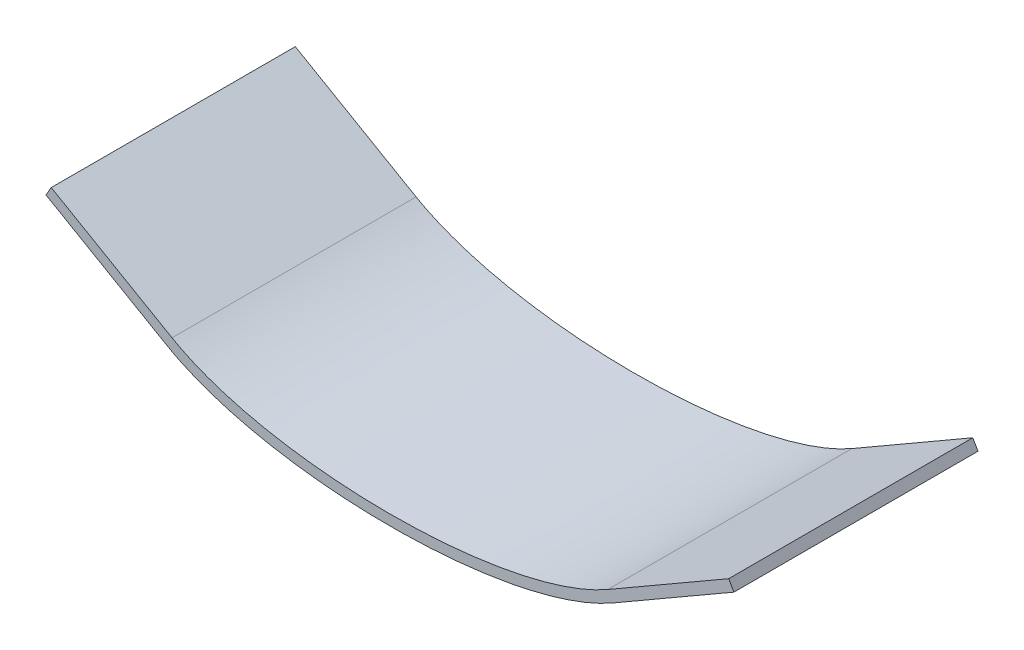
ISO-10303-21;
HEADER;
FILE_DESCRIPTION(('STEP AP214'),'2;1');
FILE_NAME('part.step','',(''),(''),'','','');
FILE_SCHEMA(('AUTOMOTIVE_DESIGN { 1 0 10303 214 1 1 1 1 }'));
ENDSEC;
DATA;
#1=APPLICATION_CONTEXT('core data for automotive mechanical design processes');
#2=APPLICATION_PROTOCOL_DEFINITION('international standard','automotive_design',2000,#1);
#3=PRODUCT_CONTEXT('',#1,'mechanical');
#4=PRODUCT('Part','Part','',(#3));
#5=PRODUCT_RELATED_PRODUCT_CATEGORY('part','',(#4));
#6=PRODUCT_DEFINITION_FORMATION('','',#4);
#7=PRODUCT_DEFINITION_CONTEXT('part definition',#1,'design');
#8=PRODUCT_DEFINITION('design','',#6,#7);
#9=PRODUCT_DEFINITION_SHAPE('','',#8);
#10=(LENGTH_UNIT() NAMED_UNIT(*) SI_UNIT(.MILLI.,.METRE.));
#11=(NAMED_UNIT(*) PLANE_ANGLE_UNIT() SI_UNIT($,.RADIAN.));
#12=(NAMED_UNIT(*) SI_UNIT($,.STERADIAN.) SOLID_ANGLE_UNIT());
#13=UNCERTAINTY_MEASURE_WITH_UNIT(LENGTH_MEASURE(1.E-05),#10,'distance_accuracy_value','');
#14=(GEOMETRIC_REPRESENTATION_CONTEXT(3) GLOBAL_UNCERTAINTY_ASSIGNED_CONTEXT((#13)) GLOBAL_UNIT_ASSIGNED_CONTEXT((#10,
#11,#12)) REPRESENTATION_CONTEXT('',''));
#15=CARTESIAN_POINT('',(0.,0.,0.));
#16=DIRECTION('',(0.,0.,1.));
#17=DIRECTION('',(1.,0.,0.));
#18=AXIS2_PLACEMENT_3D('',#15,#16,#17);
#19=CARTESIAN_POINT('',(-15.875,0.,17.78));
#20=DIRECTION('',(-0.499999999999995,-0.866025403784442,0.));
#21=DIRECTION('',(0.866025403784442,-0.499999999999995,0.));
#22=AXIS2_PLACEMENT_3D('',#19,#20,#21);
#23=PLANE('',#22);
#24=DIRECTION('',(-0.866025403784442,0.499999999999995,0.));
#25=VECTOR('',#24,1.);
#26=CARTESIAN_POINT('',(-15.875,0.,0.));
#27=LINE('',#26,#25);
#28=CARTESIAN_POINT('',(-15.875,0.,0.));
#29=VERTEX_POINT('',#28);
#30=CARTESIAN_POINT('',(-24.6738181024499,5.07999999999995,0.));
#31=VERTEX_POINT('',#30);
#32=EDGE_CURVE('E143',#29,#31,#27,.T.);
#33=ORIENTED_EDGE('',*,*,#32,.T.);
#34=DIRECTION('',(0.,0.,-1.));
#35=VECTOR('',#34,1.);
#36=CARTESIAN_POINT('',(-24.6738181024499,5.07999999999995,17.78));
#37=LINE('',#36,#35);
#38=CARTESIAN_POINT('',(-24.6738181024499,5.07999999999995,17.78));
#39=VERTEX_POINT('',#38);
#40=EDGE_CURVE('E11',#39,#31,#37,.T.);
#41=ORIENTED_EDGE('',*,*,#40,.F.);
#42=DIRECTION('',(-0.866025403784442,0.499999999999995,0.));
#43=VECTOR('',#42,1.);
#44=CARTESIAN_POINT('',(-15.875,0.,17.78));
#45=LINE('',#44,#43);
#46=CARTESIAN_POINT('',(-15.875,0.,17.78));
#47=VERTEX_POINT('',#46);
#48=EDGE_CURVE('E98',#47,#39,#45,.T.);
#49=ORIENTED_EDGE('',*,*,#48,.F.);
#50=DIRECTION('',(0.,0.,-1.));
#51=VECTOR('',#50,1.);
#52=CARTESIAN_POINT('',(-15.875,0.,17.78));
#53=LINE('',#52,#51);
#54=EDGE_CURVE('E142',#47,#29,#53,.T.);
#55=ORIENTED_EDGE('',*,*,#54,.T.);
#56=EDGE_LOOP('',(#33,#41,#49,#55));
#57=FACE_BOUND('',#56,.T.);
#58=ADVANCED_FACE('F43',(#57),#23,.F.);
#59=CARTESIAN_POINT('',(-25.0548181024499,4.4200886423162,17.78));
#60=DIRECTION('',(-0.866025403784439,0.499999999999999,0.));
#61=DIRECTION('',(-0.499999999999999,-0.866025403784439,0.));
#62=AXIS2_PLACEMENT_3D('',#59,#60,#61);
#63=PLANE('',#62);
#64=DIRECTION('',(0.499999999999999,0.866025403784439,0.));
#65=VECTOR('',#64,1.);
#66=CARTESIAN_POINT('',(-25.0548181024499,4.4200886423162,0.));
#67=LINE('',#66,#65);
#68=CARTESIAN_POINT('',(-25.0548181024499,4.4200886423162,0.));
#69=VERTEX_POINT('',#68);
#70=EDGE_CURVE('E206',#69,#31,#67,.T.);
#71=ORIENTED_EDGE('',*,*,#70,.F.);
#72=DIRECTION('',(0.,0.,-1.));
#73=VECTOR('',#72,1.);
#74=CARTESIAN_POINT('',(-25.0548181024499,4.4200886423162,17.78));
#75=LINE('',#74,#73);
#76=CARTESIAN_POINT('',(-25.0548181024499,4.4200886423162,17.78));
#77=VERTEX_POINT('',#76);
#78=EDGE_CURVE('E51',#77,#69,#75,.T.);
#79=ORIENTED_EDGE('',*,*,#78,.F.);
#80=DIRECTION('',(0.499999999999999,0.866025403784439,0.));
#81=VECTOR('',#80,1.);
#82=CARTESIAN_POINT('',(-25.0548181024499,4.4200886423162,17.78));
#83=LINE('',#82,#81);
#84=EDGE_CURVE('E179',#77,#39,#83,.T.);
#85=ORIENTED_EDGE('',*,*,#84,.T.);
#86=ORIENTED_EDGE('',*,*,#40,.T.);
#87=EDGE_LOOP('',(#71,#79,#85,#86));
#88=FACE_BOUND('',#87,.T.);
#89=ADVANCED_FACE('F207',(#88),#63,.T.);
#90=CARTESIAN_POINT('',(-16.256,-0.659911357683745,17.78));
#91=DIRECTION('',(-0.499999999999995,-0.866025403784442,0.));
#92=DIRECTION('',(0.866025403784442,-0.499999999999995,0.));
#93=AXIS2_PLACEMENT_3D('',#90,#91,#92);
#94=PLANE('',#93);
#95=DIRECTION('',(-0.866025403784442,0.499999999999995,0.));
#96=VECTOR('',#95,1.);
#97=CARTESIAN_POINT('',(-16.256,-0.659911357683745,0.));
#98=LINE('',#97,#96);
#99=CARTESIAN_POINT('',(-16.256,-0.659911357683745,0.));
#100=VERTEX_POINT('',#99);
#101=EDGE_CURVE('E201',#100,#69,#98,.T.);
#102=ORIENTED_EDGE('',*,*,#101,.F.);
#103=DIRECTION('',(0.,0.,-1.));
#104=VECTOR('',#103,1.);
#105=CARTESIAN_POINT('',(-16.256,-0.659911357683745,17.78));
#106=LINE('',#105,#104);
#107=CARTESIAN_POINT('',(-16.256,-0.659911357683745,17.78));
#108=VERTEX_POINT('',#107);
#109=EDGE_CURVE('E196',#108,#100,#106,.T.);
#110=ORIENTED_EDGE('',*,*,#109,.F.);
#111=DIRECTION('',(-0.866025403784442,0.499999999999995,0.));
#112=VECTOR('',#111,1.);
#113=CARTESIAN_POINT('',(-16.256,-0.659911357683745,17.78));
#114=LINE('',#113,#112);
#115=EDGE_CURVE('E173',#108,#77,#114,.T.);
#116=ORIENTED_EDGE('',*,*,#115,.T.);
#117=ORIENTED_EDGE('',*,*,#78,.T.);
#118=EDGE_LOOP('',(#102,#110,#116,#117));
#119=FACE_BOUND('',#118,.T.);
#120=ADVANCED_FACE('F166',(#119),#94,.T.);
#121=CARTESIAN_POINT('',(16.256,-0.659911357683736,17.78));
#122=CARTESIAN_POINT('',(15.2839702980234,-1.22111296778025,17.78));
#123=CARTESIAN_POINT('',(14.1700715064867,-1.70180875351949,17.78));
#124=CARTESIAN_POINT('',(11.7271635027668,-2.52120351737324,17.78));
#125=CARTESIAN_POINT('',(10.3979672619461,-2.85946393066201,17.78));
#126=CARTESIAN_POINT('',(6.19193156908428,-3.66956523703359,17.78));
#127=CARTESIAN_POINT('',(3.09624289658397,-3.93699999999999,17.78));
#128=CARTESIAN_POINT('',(-3.09624289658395,-3.93699999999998,17.78));
#129=CARTESIAN_POINT('',(-6.19193156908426,-3.66956523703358,17.78));
#130=CARTESIAN_POINT('',(-10.3979672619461,-2.859463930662,17.78));
#131=CARTESIAN_POINT('',(-11.7271635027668,-2.52120351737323,17.78));
#132=CARTESIAN_POINT('',(-14.1700715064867,-1.70180875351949,17.78));
#133=CARTESIAN_POINT('',(-15.2839702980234,-1.22111296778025,17.78));
#134=CARTESIAN_POINT('',(-16.256,-0.659911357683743,17.78));
#135=B_SPLINE_CURVE_WITH_KNOTS('',3,(#121,#122,#123,#124,#125,#126,#127,#128,#129,#130,#131,
#132,#133,#134),.UNSPECIFIED.,.F.,.F.,(4,2,2,2,2,2,4),(0.,0.125,0.25,0.5,0.75,0.875,1.),.UNSPECIFIED.);
#136=DIRECTION('',(0.,0.,-1.));
#137=VECTOR('',#136,1.);
#138=SURFACE_OF_LINEAR_EXTRUSION('',#135,#137);
#139=CARTESIAN_POINT('',(16.256,-0.659911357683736,0.));
#140=CARTESIAN_POINT('',(15.2839702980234,-1.22111296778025,0.));
#141=CARTESIAN_POINT('',(14.1700715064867,-1.70180875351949,0.));
#142=CARTESIAN_POINT('',(11.7271635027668,-2.52120351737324,0.));
#143=CARTESIAN_POINT('',(10.3979672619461,-2.85946393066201,0.));
#144=CARTESIAN_POINT('',(6.19193156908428,-3.66956523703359,0.));
#145=CARTESIAN_POINT('',(3.09624289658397,-3.93699999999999,0.));
#146=CARTESIAN_POINT('',(-3.09624289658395,-3.93699999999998,0.));
#147=CARTESIAN_POINT('',(-6.19193156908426,-3.66956523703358,0.));
#148=CARTESIAN_POINT('',(-10.3979672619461,-2.859463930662,0.));
#149=CARTESIAN_POINT('',(-11.7271635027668,-2.52120351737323,0.));
#150=CARTESIAN_POINT('',(-14.1700715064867,-1.70180875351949,0.));
#151=CARTESIAN_POINT('',(-15.2839702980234,-1.22111296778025,0.));
#152=CARTESIAN_POINT('',(-16.256,-0.659911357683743,0.));
#153=B_SPLINE_CURVE_WITH_KNOTS('',3,(#139,#140,#141,#142,#143,#144,#145,#146,#147,#148,#149,
#150,#151,#152),.UNSPECIFIED.,.F.,.F.,(4,2,2,2,2,2,4),(0.,0.125,0.25,0.5,0.75,0.875,1.),.UNSPECIFIED.);
#154=CARTESIAN_POINT('',(16.256,-0.659911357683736,0.));
#155=VERTEX_POINT('',#154);
#156=EDGE_CURVE('E213',#155,#100,#153,.T.);
#157=ORIENTED_EDGE('',*,*,#156,.F.);
#158=DIRECTION('',(0.,0.,-1.));
#159=VECTOR('',#158,1.);
#160=CARTESIAN_POINT('',(16.256,-0.659911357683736,17.78));
#161=LINE('',#160,#159);
#162=CARTESIAN_POINT('',(16.256,-0.659911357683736,17.78));
#163=VERTEX_POINT('',#162);
#164=EDGE_CURVE('E194',#163,#155,#161,.T.);
#165=ORIENTED_EDGE('',*,*,#164,.F.);
#166=EDGE_CURVE('E134',#163,#108,#135,.T.);
#167=ORIENTED_EDGE('',*,*,#166,.T.);
#168=ORIENTED_EDGE('',*,*,#109,.T.);
#169=EDGE_LOOP('',(#157,#165,#167,#168));
#170=FACE_BOUND('',#169,.T.);
#171=ADVANCED_FACE('F162',(#170),#138,.T.);
#172=CARTESIAN_POINT('',(16.256,-0.659911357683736,17.78));
#173=DIRECTION('',(0.500000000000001,-0.866025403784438,0.));
#174=DIRECTION('',(0.866025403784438,0.500000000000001,0.));
#175=AXIS2_PLACEMENT_3D('',#172,#173,#174);
#176=PLANE('',#175);
#177=DIRECTION('',(-0.866025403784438,-0.500000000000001,0.));
#178=VECTOR('',#177,1.);
#179=CARTESIAN_POINT('',(16.256,-0.659911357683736,0.));
#180=LINE('',#179,#178);
#181=CARTESIAN_POINT('',(25.0548181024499,4.42008864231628,0.));
#182=VERTEX_POINT('',#181);
#183=EDGE_CURVE('E215',#182,#155,#180,.T.);
#184=ORIENTED_EDGE('',*,*,#183,.F.);
#185=DIRECTION('',(0.,0.,-1.));
#186=VECTOR('',#185,1.);
#187=CARTESIAN_POINT('',(25.0548181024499,4.42008864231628,17.78));
#188=LINE('',#187,#186);
#189=CARTESIAN_POINT('',(25.0548181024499,4.42008864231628,17.78));
#190=VERTEX_POINT('',#189);
#191=EDGE_CURVE('E122',#190,#182,#188,.T.);
#192=ORIENTED_EDGE('',*,*,#191,.F.);
#193=DIRECTION('',(-0.866025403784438,-0.500000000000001,0.));
#194=VECTOR('',#193,1.);
#195=CARTESIAN_POINT('',(16.256,-0.659911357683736,17.78));
#196=LINE('',#195,#194);
#197=EDGE_CURVE('E132',#190,#163,#196,.T.);
#198=ORIENTED_EDGE('',*,*,#197,.T.);
#199=ORIENTED_EDGE('',*,*,#164,.T.);
#200=EDGE_LOOP('',(#184,#192,#198,#199));
#201=FACE_BOUND('',#200,.T.);
#202=ADVANCED_FACE('F159',(#201),#176,.T.);
#203=CARTESIAN_POINT('',(24.6738181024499,5.08000000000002,17.78));
#204=DIRECTION('',(0.866025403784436,0.500000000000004,0.));
#205=DIRECTION('',(-0.500000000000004,0.866025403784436,0.));
#206=AXIS2_PLACEMENT_3D('',#203,#204,#205);
#207=PLANE('',#206);
#208=DIRECTION('',(0.500000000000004,-0.866025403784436,0.));
#209=VECTOR('',#208,1.);
#210=CARTESIAN_POINT('',(24.6738181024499,5.08000000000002,0.));
#211=LINE('',#210,#209);
#212=CARTESIAN_POINT('',(24.6738181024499,5.08000000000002,0.));
#213=VERTEX_POINT('',#212);
#214=EDGE_CURVE('E121',#213,#182,#211,.T.);
#215=ORIENTED_EDGE('',*,*,#214,.F.);
#216=DIRECTION('',(0.,0.,-1.));
#217=VECTOR('',#216,1.);
#218=CARTESIAN_POINT('',(24.6738181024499,5.08000000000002,17.78));
#219=LINE('',#218,#217);
#220=CARTESIAN_POINT('',(24.6738181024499,5.08000000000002,17.78));
#221=VERTEX_POINT('',#220);
#222=EDGE_CURVE('E115',#221,#213,#219,.T.);
#223=ORIENTED_EDGE('',*,*,#222,.F.);
#224=DIRECTION('',(0.500000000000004,-0.866025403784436,0.));
#225=VECTOR('',#224,1.);
#226=CARTESIAN_POINT('',(24.6738181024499,5.08000000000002,17.78));
#227=LINE('',#226,#225);
#228=EDGE_CURVE('E119',#221,#190,#227,.T.);
#229=ORIENTED_EDGE('',*,*,#228,.T.);
#230=ORIENTED_EDGE('',*,*,#191,.T.);
#231=EDGE_LOOP('',(#215,#223,#229,#230));
#232=FACE_BOUND('',#231,.T.);
#233=ADVANCED_FACE('F117',(#232),#207,.T.);
#234=CARTESIAN_POINT('',(15.875,0.,17.78));
#235=DIRECTION('',(0.500000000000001,-0.866025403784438,0.));
#236=DIRECTION('',(0.866025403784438,0.500000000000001,0.));
#237=AXIS2_PLACEMENT_3D('',#234,#235,#236);
#238=PLANE('',#237);
#239=DIRECTION('',(-0.866025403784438,-0.500000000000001,0.));
#240=VECTOR('',#239,1.);
#241=CARTESIAN_POINT('',(15.875,0.,0.));
#242=LINE('',#241,#240);
#243=CARTESIAN_POINT('',(15.875,0.,0.));
#244=VERTEX_POINT('',#243);
#245=EDGE_CURVE('E86',#213,#244,#242,.T.);
#246=ORIENTED_EDGE('',*,*,#245,.T.);
#247=DIRECTION('',(0.,0.,-1.));
#248=VECTOR('',#247,1.);
#249=CARTESIAN_POINT('',(15.875,0.,17.78));
#250=LINE('',#249,#248);
#251=CARTESIAN_POINT('',(15.875,0.,17.78));
#252=VERTEX_POINT('',#251);
#253=EDGE_CURVE('E123',#252,#244,#250,.T.);
#254=ORIENTED_EDGE('',*,*,#253,.F.);
#255=DIRECTION('',(-0.866025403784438,-0.500000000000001,0.));
#256=VECTOR('',#255,1.);
#257=CARTESIAN_POINT('',(15.875,0.,17.78));
#258=LINE('',#257,#256);
#259=EDGE_CURVE('E125',#221,#252,#258,.T.);
#260=ORIENTED_EDGE('',*,*,#259,.F.);
#261=ORIENTED_EDGE('',*,*,#222,.T.);
#262=EDGE_LOOP('',(#246,#254,#260,#261));
#263=FACE_BOUND('',#262,.T.);
#264=ADVANCED_FACE('F126',(#263),#238,.F.);
#265=CARTESIAN_POINT('',(15.875,0.,17.78));
#266=CARTESIAN_POINT('',(8.54265158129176,-4.23333333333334,17.78));
#267=CARTESIAN_POINT('',(-8.54265158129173,-4.23333333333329,17.78));
#268=CARTESIAN_POINT('',(-15.875,0.,17.78));
#269=B_SPLINE_CURVE_WITH_KNOTS('',3,(#265,#266,#267,#268),.UNSPECIFIED.,.F.,.F.,(4,4),(0.,1.),.UNSPECIFIED.);
#270=DIRECTION('',(0.,0.,-1.));
#271=VECTOR('',#270,1.);
#272=SURFACE_OF_LINEAR_EXTRUSION('',#269,#271);
#273=CARTESIAN_POINT('',(15.875,0.,0.));
#274=CARTESIAN_POINT('',(8.54265158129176,-4.23333333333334,0.));
#275=CARTESIAN_POINT('',(-8.54265158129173,-4.23333333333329,0.));
#276=CARTESIAN_POINT('',(-15.875,0.,0.));
#277=B_SPLINE_CURVE_WITH_KNOTS('',3,(#273,#274,#275,#276),.UNSPECIFIED.,.F.,.F.,(4,4),(0.,1.),.UNSPECIFIED.);
#278=EDGE_CURVE('E92',#244,#29,#277,.T.);
#279=ORIENTED_EDGE('',*,*,#278,.T.);
#280=ORIENTED_EDGE('',*,*,#54,.F.);
#281=EDGE_CURVE('E59',#252,#47,#269,.T.);
#282=ORIENTED_EDGE('',*,*,#281,.F.);
#283=ORIENTED_EDGE('',*,*,#253,.T.);
#284=EDGE_LOOP('',(#279,#280,#282,#283));
#285=FACE_BOUND('',#284,.T.);
#286=ADVANCED_FACE('F149',(#285),#272,.F.);
#287=CARTESIAN_POINT('',(0.,-3.93699999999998,17.78));
#288=DIRECTION('',(0.,0.,1.));
#289=DIRECTION('',(1.,0.,0.));
#290=AXIS2_PLACEMENT_3D('',#287,#288,#289);
#291=PLANE('',#290);
#292=ORIENTED_EDGE('',*,*,#48,.T.);
#293=ORIENTED_EDGE('',*,*,#84,.F.);
#294=ORIENTED_EDGE('',*,*,#115,.F.);
#295=ORIENTED_EDGE('',*,*,#166,.F.);
#296=ORIENTED_EDGE('',*,*,#197,.F.);
#297=ORIENTED_EDGE('',*,*,#228,.F.);
#298=ORIENTED_EDGE('',*,*,#259,.T.);
#299=ORIENTED_EDGE('',*,*,#281,.T.);
#300=EDGE_LOOP('',(#292,#293,#294,#295,#296,#297,#298,#299));
#301=FACE_BOUND('',#300,.T.);
#302=ADVANCED_FACE('F129',(#301),#291,.T.);
#303=CARTESIAN_POINT('',(0.,-3.93699999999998,0.));
#304=DIRECTION('',(0.,0.,1.));
#305=DIRECTION('',(1.,0.,0.));
#306=AXIS2_PLACEMENT_3D('',#303,#304,#305);
#307=PLANE('',#306);
#308=ORIENTED_EDGE('',*,*,#32,.F.);
#309=ORIENTED_EDGE('',*,*,#278,.F.);
#310=ORIENTED_EDGE('',*,*,#245,.F.);
#311=ORIENTED_EDGE('',*,*,#214,.T.);
#312=ORIENTED_EDGE('',*,*,#183,.T.);
#313=ORIENTED_EDGE('',*,*,#156,.T.);
#314=ORIENTED_EDGE('',*,*,#101,.T.);
#315=ORIENTED_EDGE('',*,*,#70,.T.);
#316=EDGE_LOOP('',(#308,#309,#310,#311,#312,#313,#314,#315));
#317=FACE_BOUND('',#316,.T.);
#318=ADVANCED_FACE('F153',(#317),#307,.F.);
#319=CLOSED_SHELL('',(#58,#89,#120,#171,#202,#233,#264,#286,#302,#318));
#320=MANIFOLD_SOLID_BREP('B2',#319);
#321=ADVANCED_BREP_SHAPE_REPRESENTATION('',(#18,#320),#14);
#322=SHAPE_DEFINITION_REPRESENTATION(#9,#321);
ENDSEC;
END-ISO-10303-21;
